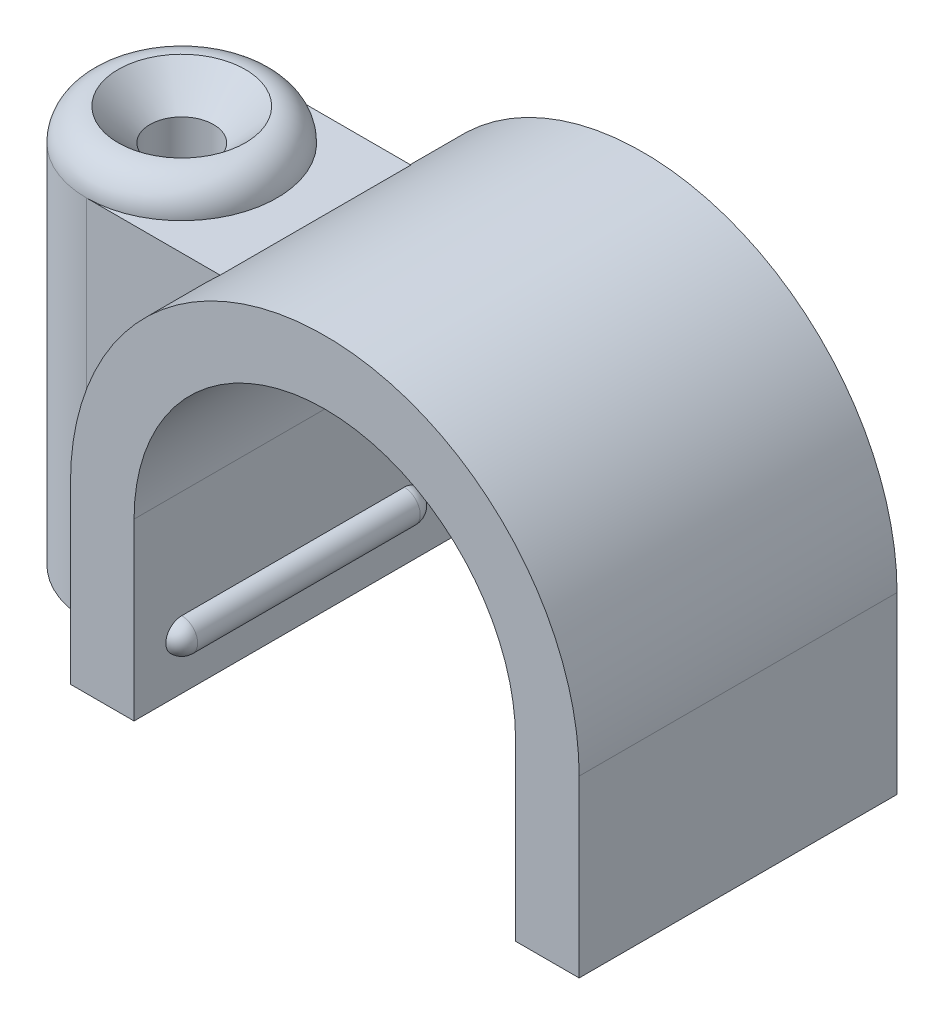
ISO-10303-21;
HEADER;
FILE_DESCRIPTION(('STEP AP214'),'2;1');
FILE_NAME('part.step','',(''),(''),'','','');
FILE_SCHEMA(('AUTOMOTIVE_DESIGN { 1 0 10303 214 1 1 1 1 }'));
ENDSEC;
DATA;
#1=APPLICATION_CONTEXT('core data for automotive mechanical design processes');
#2=APPLICATION_PROTOCOL_DEFINITION('international standard','automotive_design',2000,#1);
#3=PRODUCT_CONTEXT('',#1,'mechanical');
#4=PRODUCT('Part','Part','',(#3));
#5=PRODUCT_RELATED_PRODUCT_CATEGORY('part','',(#4));
#6=PRODUCT_DEFINITION_FORMATION('','',#4);
#7=PRODUCT_DEFINITION_CONTEXT('part definition',#1,'design');
#8=PRODUCT_DEFINITION('design','',#6,#7);
#9=PRODUCT_DEFINITION_SHAPE('','',#8);
#10=(LENGTH_UNIT() NAMED_UNIT(*) SI_UNIT(.MILLI.,.METRE.));
#11=(NAMED_UNIT(*) PLANE_ANGLE_UNIT() SI_UNIT($,.RADIAN.));
#12=(NAMED_UNIT(*) SI_UNIT($,.STERADIAN.) SOLID_ANGLE_UNIT());
#13=UNCERTAINTY_MEASURE_WITH_UNIT(LENGTH_MEASURE(1.E-05),#10,'distance_accuracy_value','');
#14=(GEOMETRIC_REPRESENTATION_CONTEXT(3) GLOBAL_UNCERTAINTY_ASSIGNED_CONTEXT((#13)) GLOBAL_UNIT_ASSIGNED_CONTEXT((#10,
#11,#12)) REPRESENTATION_CONTEXT('',''));
#15=CARTESIAN_POINT('',(0.,0.,0.));
#16=DIRECTION('',(0.,0.,1.));
#17=DIRECTION('',(1.,0.,0.));
#18=AXIS2_PLACEMENT_3D('',#15,#16,#17);
#19=CARTESIAN_POINT('',(0.,0.,-10.));
#20=DIRECTION('',(0.,-1.,0.));
#21=DIRECTION('',(0.,0.,-1.));
#22=AXIS2_PLACEMENT_3D('',#19,#20,#21);
#23=PLANE('',#22);
#24=DIRECTION('',(0.,0.,1.));
#25=VECTOR('',#24,1.);
#26=CARTESIAN_POINT('',(0.,0.,-10.));
#27=LINE('',#26,#25);
#28=CARTESIAN_POINT('',(0.,0.,-2.));
#29=VERTEX_POINT('',#28);
#30=CARTESIAN_POINT('',(0.,0.,0.));
#31=VERTEX_POINT('',#30);
#32=EDGE_CURVE('E262',#29,#31,#27,.T.);
#33=ORIENTED_EDGE('',*,*,#32,.F.);
#34=DIRECTION('',(-1.,0.,0.));
#35=VECTOR('',#34,1.);
#36=CARTESIAN_POINT('',(16.001,0.,-2.));
#37=LINE('',#36,#35);
#38=CARTESIAN_POINT('',(-1.5,0.,-2.));
#39=VERTEX_POINT('',#38);
#40=EDGE_CURVE('E172',#29,#39,#37,.T.);
#41=ORIENTED_EDGE('',*,*,#40,.T.);
#42=CARTESIAN_POINT('',(-1.5,0.,-5.));
#43=DIRECTION('',(0.,-1.,0.));
#44=DIRECTION('',(0.,0.,-1.));
#45=AXIS2_PLACEMENT_3D('',#42,#43,#44);
#46=CIRCLE('',#45,3.);
#47=CARTESIAN_POINT('',(-1.5,0.,-8.));
#48=VERTEX_POINT('',#47);
#49=EDGE_CURVE('E201',#39,#48,#46,.T.);
#50=ORIENTED_EDGE('',*,*,#49,.T.);
#51=DIRECTION('',(-1.,0.,0.));
#52=VECTOR('',#51,1.);
#53=CARTESIAN_POINT('',(16.001,0.,-8.));
#54=LINE('',#53,#52);
#55=CARTESIAN_POINT('',(0.,0.,-8.));
#56=VERTEX_POINT('',#55);
#57=EDGE_CURVE('E190',#56,#48,#54,.T.);
#58=ORIENTED_EDGE('',*,*,#57,.F.);
#59=CARTESIAN_POINT('',(0.,0.,-10.));
#60=VERTEX_POINT('',#59);
#61=EDGE_CURVE('E258',#60,#56,#27,.T.);
#62=ORIENTED_EDGE('',*,*,#61,.F.);
#63=DIRECTION('',(1.,0.,0.));
#64=VECTOR('',#63,1.);
#65=CARTESIAN_POINT('',(0.,0.,-10.));
#66=LINE('',#65,#64);
#67=CARTESIAN_POINT('',(2.,0.,-10.));
#68=VERTEX_POINT('',#67);
#69=EDGE_CURVE('E234',#60,#68,#66,.T.);
#70=ORIENTED_EDGE('',*,*,#69,.T.);
#71=DIRECTION('',(0.,0.,1.));
#72=VECTOR('',#71,1.);
#73=CARTESIAN_POINT('',(2.,0.,-10.));
#74=LINE('',#73,#72);
#75=CARTESIAN_POINT('',(2.,0.,0.));
#76=VERTEX_POINT('',#75);
#77=EDGE_CURVE('E257',#68,#76,#74,.T.);
#78=ORIENTED_EDGE('',*,*,#77,.T.);
#79=DIRECTION('',(1.,0.,0.));
#80=VECTOR('',#79,1.);
#81=CARTESIAN_POINT('',(0.,0.,0.));
#82=LINE('',#81,#80);
#83=EDGE_CURVE('E210',#31,#76,#82,.T.);
#84=ORIENTED_EDGE('',*,*,#83,.F.);
#85=EDGE_LOOP('',(#33,#41,#50,#58,#62,#70,#78,#84));
#86=FACE_BOUND('',#85,.T.);
#87=CARTESIAN_POINT('',(-1.5,1.1369377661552E-11,-5.));
#88=DIRECTION('',(0.,1.,0.));
#89=DIRECTION('',(0.,0.,1.));
#90=AXIS2_PLACEMENT_3D('',#87,#88,#89);
#91=CIRCLE('',#90,0.999999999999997);
#92=CARTESIAN_POINT('',(-1.5,1.1369377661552E-11,-4.));
#93=VERTEX_POINT('',#92);
#94=EDGE_CURVE('E336',#93,#93,#91,.T.);
#95=ORIENTED_EDGE('',*,*,#94,.T.);
#96=EDGE_LOOP('',(#95));
#97=FACE_BOUND('',#96,.T.);
#98=ADVANCED_FACE('F33',(#86,#97),#23,.T.);
#99=CARTESIAN_POINT('',(0.,0.,-10.));
#100=DIRECTION('',(-1.,0.,0.));
#101=DIRECTION('',(0.,0.,1.));
#102=AXIS2_PLACEMENT_3D('',#99,#100,#101);
#103=PLANE('',#102);
#104=ORIENTED_EDGE('',*,*,#61,.T.);
#105=DIRECTION('',(0.,-1.,0.));
#106=VECTOR('',#105,1.);
#107=CARTESIAN_POINT('',(0.,0.,-8.));
#108=LINE('',#107,#106);
#109=CARTESIAN_POINT('',(0.,5.5,-8.));
#110=VERTEX_POINT('',#109);
#111=EDGE_CURVE('E187',#110,#56,#108,.T.);
#112=ORIENTED_EDGE('',*,*,#111,.F.);
#113=DIRECTION('',(0.,0.,1.));
#114=VECTOR('',#113,1.);
#115=CARTESIAN_POINT('',(0.,5.5,-10.));
#116=LINE('',#115,#114);
#117=CARTESIAN_POINT('',(0.,5.5,-10.));
#118=VERTEX_POINT('',#117);
#119=EDGE_CURVE('E186',#118,#110,#116,.T.);
#120=ORIENTED_EDGE('',*,*,#119,.F.);
#121=DIRECTION('',(0.,-1.,0.));
#122=VECTOR('',#121,1.);
#123=CARTESIAN_POINT('',(0.,0.,-10.));
#124=LINE('',#123,#122);
#125=EDGE_CURVE('E254',#118,#60,#124,.T.);
#126=ORIENTED_EDGE('',*,*,#125,.T.);
#127=EDGE_LOOP('',(#104,#112,#120,#126));
#128=FACE_BOUND('',#127,.T.);
#129=ADVANCED_FACE('F321',(#128),#103,.T.);
#130=CARTESIAN_POINT('',(0.,5.5,-2.));
#131=VERTEX_POINT('',#130);
#132=CARTESIAN_POINT('',(0.,5.5,0.));
#133=VERTEX_POINT('',#132);
#134=EDGE_CURVE('E264',#131,#133,#116,.T.);
#135=ORIENTED_EDGE('',*,*,#134,.F.);
#136=DIRECTION('',(0.,1.,0.));
#137=VECTOR('',#136,1.);
#138=CARTESIAN_POINT('',(0.,0.,-2.));
#139=LINE('',#138,#137);
#140=EDGE_CURVE('E198',#29,#131,#139,.T.);
#141=ORIENTED_EDGE('',*,*,#140,.F.);
#142=ORIENTED_EDGE('',*,*,#32,.T.);
#143=DIRECTION('',(0.,-1.,0.));
#144=VECTOR('',#143,1.);
#145=CARTESIAN_POINT('',(0.,0.,0.));
#146=LINE('',#145,#144);
#147=EDGE_CURVE('E231',#133,#31,#146,.T.);
#148=ORIENTED_EDGE('',*,*,#147,.F.);
#149=EDGE_LOOP('',(#135,#141,#142,#148));
#150=FACE_BOUND('',#149,.T.);
#151=ADVANCED_FACE('F328',(#150),#103,.T.);
#152=CARTESIAN_POINT('',(8.,5.5,-10.));
#153=DIRECTION('',(0.,0.,1.));
#154=DIRECTION('',(1.,0.,0.));
#155=AXIS2_PLACEMENT_3D('',#152,#153,#154);
#156=CYLINDRICAL_SURFACE('',#155,8.);
#157=ORIENTED_EDGE('',*,*,#119,.T.);
#158=CARTESIAN_POINT('',(8.,5.5,-8.));
#159=DIRECTION('',(0.,0.,1.));
#160=DIRECTION('',(1.,0.,0.));
#161=AXIS2_PLACEMENT_3D('',#158,#159,#160);
#162=CIRCLE('',#161,8.);
#163=CARTESIAN_POINT('',(2.70849737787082,11.5,-8.));
#164=VERTEX_POINT('',#163);
#165=EDGE_CURVE('E177',#164,#110,#162,.T.);
#166=ORIENTED_EDGE('',*,*,#165,.F.);
#167=DIRECTION('',(0.,0.,1.));
#168=VECTOR('',#167,1.);
#169=CARTESIAN_POINT('',(2.70849737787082,11.5,-10.));
#170=LINE('',#169,#168);
#171=CARTESIAN_POINT('',(2.70849737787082,11.5,-2.));
#172=VERTEX_POINT('',#171);
#173=EDGE_CURVE('E161',#172,#164,#170,.F.);
#174=ORIENTED_EDGE('',*,*,#173,.F.);
#175=CARTESIAN_POINT('',(8.,5.5,-2.));
#176=DIRECTION('',(0.,0.,-1.));
#177=DIRECTION('',(0.,1.,0.));
#178=AXIS2_PLACEMENT_3D('',#175,#176,#177);
#179=CIRCLE('',#178,8.);
#180=EDGE_CURVE('E200',#131,#172,#179,.T.);
#181=ORIENTED_EDGE('',*,*,#180,.F.);
#182=ORIENTED_EDGE('',*,*,#134,.T.);
#183=CARTESIAN_POINT('',(8.,5.5,0.));
#184=DIRECTION('',(0.,0.,1.));
#185=DIRECTION('',(-1.,0.,0.));
#186=AXIS2_PLACEMENT_3D('',#183,#184,#185);
#187=CIRCLE('',#186,8.);
#188=CARTESIAN_POINT('',(16.,5.5,0.));
#189=VERTEX_POINT('',#188);
#190=EDGE_CURVE('E228',#189,#133,#187,.T.);
#191=ORIENTED_EDGE('',*,*,#190,.F.);
#192=DIRECTION('',(0.,0.,1.));
#193=VECTOR('',#192,1.);
#194=CARTESIAN_POINT('',(16.,5.5,-10.));
#195=LINE('',#194,#193);
#196=CARTESIAN_POINT('',(16.,5.5,-10.));
#197=VERTEX_POINT('',#196);
#198=EDGE_CURVE('E265',#197,#189,#195,.T.);
#199=ORIENTED_EDGE('',*,*,#198,.F.);
#200=CARTESIAN_POINT('',(8.,5.5,-10.));
#201=DIRECTION('',(0.,0.,1.));
#202=DIRECTION('',(-1.,0.,0.));
#203=AXIS2_PLACEMENT_3D('',#200,#201,#202);
#204=CIRCLE('',#203,8.);
#205=EDGE_CURVE('E252',#197,#118,#204,.T.);
#206=ORIENTED_EDGE('',*,*,#205,.T.);
#207=EDGE_LOOP('',(#157,#166,#174,#181,#182,#191,#199,#206));
#208=FACE_BOUND('',#207,.T.);
#209=ADVANCED_FACE('F184',(#208),#156,.T.);
#210=CARTESIAN_POINT('',(16.,0.,-10.));
#211=DIRECTION('',(1.,0.,0.));
#212=DIRECTION('',(0.,0.,-1.));
#213=AXIS2_PLACEMENT_3D('',#210,#211,#212);
#214=PLANE('',#213);
#215=DIRECTION('',(0.,1.,0.));
#216=VECTOR('',#215,1.);
#217=CARTESIAN_POINT('',(16.,0.,0.));
#218=LINE('',#217,#216);
#219=CARTESIAN_POINT('',(16.,0.,0.));
#220=VERTEX_POINT('',#219);
#221=EDGE_CURVE('E225',#220,#189,#218,.T.);
#222=ORIENTED_EDGE('',*,*,#221,.F.);
#223=DIRECTION('',(0.,0.,1.));
#224=VECTOR('',#223,1.);
#225=CARTESIAN_POINT('',(16.,0.,-10.));
#226=LINE('',#225,#224);
#227=CARTESIAN_POINT('',(16.,0.,-10.));
#228=VERTEX_POINT('',#227);
#229=EDGE_CURVE('E267',#228,#220,#226,.T.);
#230=ORIENTED_EDGE('',*,*,#229,.F.);
#231=DIRECTION('',(0.,1.,0.));
#232=VECTOR('',#231,1.);
#233=CARTESIAN_POINT('',(16.,0.,-10.));
#234=LINE('',#233,#232);
#235=EDGE_CURVE('E249',#228,#197,#234,.T.);
#236=ORIENTED_EDGE('',*,*,#235,.T.);
#237=ORIENTED_EDGE('',*,*,#198,.T.);
#238=EDGE_LOOP('',(#222,#230,#236,#237));
#239=FACE_BOUND('',#238,.T.);
#240=ADVANCED_FACE('F376',(#239),#214,.T.);
#241=CARTESIAN_POINT('',(14.,0.,-10.));
#242=DIRECTION('',(0.,-1.,0.));
#243=DIRECTION('',(0.,0.,-1.));
#244=AXIS2_PLACEMENT_3D('',#241,#242,#243);
#245=PLANE('',#244);
#246=DIRECTION('',(1.,0.,0.));
#247=VECTOR('',#246,1.);
#248=CARTESIAN_POINT('',(14.,0.,0.));
#249=LINE('',#248,#247);
#250=CARTESIAN_POINT('',(14.,0.,0.));
#251=VERTEX_POINT('',#250);
#252=EDGE_CURVE('E222',#251,#220,#249,.T.);
#253=ORIENTED_EDGE('',*,*,#252,.F.);
#254=DIRECTION('',(0.,0.,1.));
#255=VECTOR('',#254,1.);
#256=CARTESIAN_POINT('',(14.,0.,-10.));
#257=LINE('',#256,#255);
#258=CARTESIAN_POINT('',(14.,0.,-10.));
#259=VERTEX_POINT('',#258);
#260=EDGE_CURVE('E269',#259,#251,#257,.T.);
#261=ORIENTED_EDGE('',*,*,#260,.F.);
#262=DIRECTION('',(1.,0.,0.));
#263=VECTOR('',#262,1.);
#264=CARTESIAN_POINT('',(14.,0.,-10.));
#265=LINE('',#264,#263);
#266=EDGE_CURVE('E246',#259,#228,#265,.T.);
#267=ORIENTED_EDGE('',*,*,#266,.T.);
#268=ORIENTED_EDGE('',*,*,#229,.T.);
#269=EDGE_LOOP('',(#253,#261,#267,#268));
#270=FACE_BOUND('',#269,.T.);
#271=ADVANCED_FACE('F380',(#270),#245,.T.);
#272=CARTESIAN_POINT('',(14.,0.,-10.));
#273=DIRECTION('',(-1.,0.,0.));
#274=DIRECTION('',(0.,0.,1.));
#275=AXIS2_PLACEMENT_3D('',#272,#273,#274);
#276=PLANE('',#275);
#277=CARTESIAN_POINT('',(14.,1.61906828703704,-1.5));
#278=DIRECTION('',(-1.,0.,0.));
#279=DIRECTION('',(0.,0.,1.));
#280=AXIS2_PLACEMENT_3D('',#277,#278,#279);
#281=CIRCLE('',#280,0.5);
#282=CARTESIAN_POINT('',(14.,2.11906828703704,-1.5));
#283=VERTEX_POINT('',#282);
#284=CARTESIAN_POINT('',(14.,1.61906828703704,-1.));
#285=VERTEX_POINT('',#284);
#286=EDGE_CURVE('E52',#283,#285,#281,.F.);
#287=ORIENTED_EDGE('',*,*,#286,.T.);
#288=CARTESIAN_POINT('',(14.,1.61906828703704,-1.5));
#289=DIRECTION('',(-1.,0.,0.));
#290=DIRECTION('',(0.,0.,1.));
#291=AXIS2_PLACEMENT_3D('',#288,#289,#290);
#292=CIRCLE('',#291,0.5);
#293=CARTESIAN_POINT('',(14.,1.11906828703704,-1.5));
#294=VERTEX_POINT('',#293);
#295=EDGE_CURVE('E298',#285,#294,#292,.F.);
#296=ORIENTED_EDGE('',*,*,#295,.T.);
#297=DIRECTION('',(0.,0.,-1.));
#298=VECTOR('',#297,1.);
#299=CARTESIAN_POINT('',(14.,1.11906828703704,-1.));
#300=LINE('',#299,#298);
#301=CARTESIAN_POINT('',(14.,1.11906828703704,-8.5));
#302=VERTEX_POINT('',#301);
#303=EDGE_CURVE('E309',#294,#302,#300,.T.);
#304=ORIENTED_EDGE('',*,*,#303,.T.);
#305=CARTESIAN_POINT('',(14.,1.61906828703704,-8.5));
#306=DIRECTION('',(-1.,0.,0.));
#307=DIRECTION('',(0.,0.,1.));
#308=AXIS2_PLACEMENT_3D('',#305,#306,#307);
#309=CIRCLE('',#308,0.5);
#310=CARTESIAN_POINT('',(14.,1.61906828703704,-9.));
#311=VERTEX_POINT('',#310);
#312=EDGE_CURVE('E13',#302,#311,#309,.F.);
#313=ORIENTED_EDGE('',*,*,#312,.T.);
#314=CARTESIAN_POINT('',(14.,1.61906828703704,-8.5));
#315=DIRECTION('',(-1.,0.,0.));
#316=DIRECTION('',(0.,0.,1.));
#317=AXIS2_PLACEMENT_3D('',#314,#315,#316);
#318=CIRCLE('',#317,0.5);
#319=CARTESIAN_POINT('',(14.,2.11906828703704,-8.5));
#320=VERTEX_POINT('',#319);
#321=EDGE_CURVE('E40',#311,#320,#318,.F.);
#322=ORIENTED_EDGE('',*,*,#321,.T.);
#323=DIRECTION('',(0.,0.,-1.));
#324=VECTOR('',#323,1.);
#325=CARTESIAN_POINT('',(14.,2.11906828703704,-1.));
#326=LINE('',#325,#324);
#327=EDGE_CURVE('E302',#283,#320,#326,.T.);
#328=ORIENTED_EDGE('',*,*,#327,.F.);
#329=EDGE_LOOP('',(#287,#296,#304,#313,#322,#328));
#330=FACE_BOUND('',#329,.T.);
#331=DIRECTION('',(0.,-1.,0.));
#332=VECTOR('',#331,1.);
#333=CARTESIAN_POINT('',(14.,0.,0.));
#334=LINE('',#333,#332);
#335=CARTESIAN_POINT('',(14.,5.5,0.));
#336=VERTEX_POINT('',#335);
#337=EDGE_CURVE('E219',#336,#251,#334,.T.);
#338=ORIENTED_EDGE('',*,*,#337,.F.);
#339=DIRECTION('',(0.,0.,1.));
#340=VECTOR('',#339,1.);
#341=CARTESIAN_POINT('',(14.,5.5,-10.));
#342=LINE('',#341,#340);
#343=CARTESIAN_POINT('',(14.,5.5,-10.));
#344=VERTEX_POINT('',#343);
#345=EDGE_CURVE('E271',#344,#336,#342,.T.);
#346=ORIENTED_EDGE('',*,*,#345,.F.);
#347=DIRECTION('',(0.,-1.,0.));
#348=VECTOR('',#347,1.);
#349=CARTESIAN_POINT('',(14.,0.,-10.));
#350=LINE('',#349,#348);
#351=EDGE_CURVE('E243',#344,#259,#350,.T.);
#352=ORIENTED_EDGE('',*,*,#351,.T.);
#353=ORIENTED_EDGE('',*,*,#260,.T.);
#354=EDGE_LOOP('',(#338,#346,#352,#353));
#355=FACE_BOUND('',#354,.T.);
#356=ADVANCED_FACE('F300',(#330,#355),#276,.T.);
#357=CARTESIAN_POINT('',(8.,5.5,-10.));
#358=DIRECTION('',(0.,0.,1.));
#359=DIRECTION('',(1.,0.,0.));
#360=AXIS2_PLACEMENT_3D('',#357,#358,#359);
#361=CYLINDRICAL_SURFACE('',#360,6.);
#362=CARTESIAN_POINT('',(8.,5.5,0.));
#363=DIRECTION('',(0.,0.,-1.));
#364=DIRECTION('',(-1.,0.,0.));
#365=AXIS2_PLACEMENT_3D('',#362,#363,#364);
#366=CIRCLE('',#365,6.);
#367=CARTESIAN_POINT('',(2.,5.5,0.));
#368=VERTEX_POINT('',#367);
#369=EDGE_CURVE('E216',#368,#336,#366,.T.);
#370=ORIENTED_EDGE('',*,*,#369,.F.);
#371=DIRECTION('',(0.,0.,1.));
#372=VECTOR('',#371,1.);
#373=CARTESIAN_POINT('',(2.,5.5,-10.));
#374=LINE('',#373,#372);
#375=CARTESIAN_POINT('',(2.,5.5,-10.));
#376=VERTEX_POINT('',#375);
#377=EDGE_CURVE('E273',#376,#368,#374,.T.);
#378=ORIENTED_EDGE('',*,*,#377,.F.);
#379=CARTESIAN_POINT('',(8.,5.5,-10.));
#380=DIRECTION('',(0.,0.,-1.));
#381=DIRECTION('',(-1.,0.,0.));
#382=AXIS2_PLACEMENT_3D('',#379,#380,#381);
#383=CIRCLE('',#382,6.);
#384=EDGE_CURVE('E240',#376,#344,#383,.T.);
#385=ORIENTED_EDGE('',*,*,#384,.T.);
#386=ORIENTED_EDGE('',*,*,#345,.T.);
#387=EDGE_LOOP('',(#370,#378,#385,#386));
#388=FACE_BOUND('',#387,.T.);
#389=ADVANCED_FACE('F383',(#388),#361,.F.);
#390=CARTESIAN_POINT('',(2.,0.,-10.));
#391=DIRECTION('',(1.,0.,0.));
#392=DIRECTION('',(0.,0.,-1.));
#393=AXIS2_PLACEMENT_3D('',#390,#391,#392);
#394=PLANE('',#393);
#395=DIRECTION('',(0.,0.,-1.));
#396=VECTOR('',#395,1.);
#397=CARTESIAN_POINT('',(2.,1.11906828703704,-1.));
#398=LINE('',#397,#396);
#399=CARTESIAN_POINT('',(2.,1.11906828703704,-1.5));
#400=VERTEX_POINT('',#399);
#401=CARTESIAN_POINT('',(2.,1.11906828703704,-8.5));
#402=VERTEX_POINT('',#401);
#403=EDGE_CURVE('E343',#400,#402,#398,.T.);
#404=ORIENTED_EDGE('',*,*,#403,.F.);
#405=CARTESIAN_POINT('',(2.,1.61906828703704,-1.5));
#406=DIRECTION('',(1.,0.,0.));
#407=DIRECTION('',(0.,0.,-1.));
#408=AXIS2_PLACEMENT_3D('',#405,#406,#407);
#409=CIRCLE('',#408,0.5);
#410=CARTESIAN_POINT('',(2.,1.61906828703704,-1.));
#411=VERTEX_POINT('',#410);
#412=EDGE_CURVE('E285',#400,#411,#409,.F.);
#413=ORIENTED_EDGE('',*,*,#412,.T.);
#414=CARTESIAN_POINT('',(2.,1.61906828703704,-1.5));
#415=DIRECTION('',(1.,0.,0.));
#416=DIRECTION('',(0.,0.,-1.));
#417=AXIS2_PLACEMENT_3D('',#414,#415,#416);
#418=CIRCLE('',#417,0.5);
#419=CARTESIAN_POINT('',(2.,2.11906828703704,-1.5));
#420=VERTEX_POINT('',#419);
#421=EDGE_CURVE('E283',#411,#420,#418,.F.);
#422=ORIENTED_EDGE('',*,*,#421,.T.);
#423=DIRECTION('',(0.,0.,-1.));
#424=VECTOR('',#423,1.);
#425=CARTESIAN_POINT('',(2.,2.11906828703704,-1.));
#426=LINE('',#425,#424);
#427=CARTESIAN_POINT('',(2.,2.11906828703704,-8.5));
#428=VERTEX_POINT('',#427);
#429=EDGE_CURVE('E338',#420,#428,#426,.T.);
#430=ORIENTED_EDGE('',*,*,#429,.T.);
#431=CARTESIAN_POINT('',(2.,1.61906828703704,-8.5));
#432=DIRECTION('',(1.,0.,0.));
#433=DIRECTION('',(0.,0.,-1.));
#434=AXIS2_PLACEMENT_3D('',#431,#432,#433);
#435=CIRCLE('',#434,0.5);
#436=CARTESIAN_POINT('',(2.,1.61906828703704,-9.));
#437=VERTEX_POINT('',#436);
#438=EDGE_CURVE('E287',#428,#437,#435,.F.);
#439=ORIENTED_EDGE('',*,*,#438,.T.);
#440=CARTESIAN_POINT('',(2.,1.61906828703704,-8.5));
#441=DIRECTION('',(1.,0.,0.));
#442=DIRECTION('',(0.,0.,-1.));
#443=AXIS2_PLACEMENT_3D('',#440,#441,#442);
#444=CIRCLE('',#443,0.5);
#445=EDGE_CURVE('E289',#437,#402,#444,.F.);
#446=ORIENTED_EDGE('',*,*,#445,.T.);
#447=EDGE_LOOP('',(#404,#413,#422,#430,#439,#446));
#448=FACE_BOUND('',#447,.T.);
#449=DIRECTION('',(0.,1.,0.));
#450=VECTOR('',#449,1.);
#451=CARTESIAN_POINT('',(2.,0.,0.));
#452=LINE('',#451,#450);
#453=EDGE_CURVE('E213',#76,#368,#452,.T.);
#454=ORIENTED_EDGE('',*,*,#453,.F.);
#455=ORIENTED_EDGE('',*,*,#77,.F.);
#456=DIRECTION('',(0.,1.,0.));
#457=VECTOR('',#456,1.);
#458=CARTESIAN_POINT('',(2.,0.,-10.));
#459=LINE('',#458,#457);
#460=EDGE_CURVE('E237',#68,#376,#459,.T.);
#461=ORIENTED_EDGE('',*,*,#460,.T.);
#462=ORIENTED_EDGE('',*,*,#377,.T.);
#463=EDGE_LOOP('',(#454,#455,#461,#462));
#464=FACE_BOUND('',#463,.T.);
#465=ADVANCED_FACE('F365',(#448,#464),#394,.T.);
#466=CARTESIAN_POINT('',(8.,5.5,-10.));
#467=DIRECTION('',(0.,0.,-1.));
#468=DIRECTION('',(-1.,0.,0.));
#469=AXIS2_PLACEMENT_3D('',#466,#467,#468);
#470=PLANE('',#469);
#471=ORIENTED_EDGE('',*,*,#69,.F.);
#472=ORIENTED_EDGE('',*,*,#125,.F.);
#473=ORIENTED_EDGE('',*,*,#205,.F.);
#474=ORIENTED_EDGE('',*,*,#235,.F.);
#475=ORIENTED_EDGE('',*,*,#266,.F.);
#476=ORIENTED_EDGE('',*,*,#351,.F.);
#477=ORIENTED_EDGE('',*,*,#384,.F.);
#478=ORIENTED_EDGE('',*,*,#460,.F.);
#479=EDGE_LOOP('',(#471,#472,#473,#474,#475,#476,#477,#478));
#480=FACE_BOUND('',#479,.T.);
#481=ADVANCED_FACE('F359',(#480),#470,.T.);
#482=CARTESIAN_POINT('',(8.,5.5,0.));
#483=DIRECTION('',(0.,0.,-1.));
#484=DIRECTION('',(-1.,0.,0.));
#485=AXIS2_PLACEMENT_3D('',#482,#483,#484);
#486=PLANE('',#485);
#487=ORIENTED_EDGE('',*,*,#83,.T.);
#488=ORIENTED_EDGE('',*,*,#453,.T.);
#489=ORIENTED_EDGE('',*,*,#369,.T.);
#490=ORIENTED_EDGE('',*,*,#337,.T.);
#491=ORIENTED_EDGE('',*,*,#252,.T.);
#492=ORIENTED_EDGE('',*,*,#221,.T.);
#493=ORIENTED_EDGE('',*,*,#190,.T.);
#494=ORIENTED_EDGE('',*,*,#147,.T.);
#495=EDGE_LOOP('',(#487,#488,#489,#490,#491,#492,#493,#494));
#496=FACE_BOUND('',#495,.T.);
#497=ADVANCED_FACE('F368',(#496),#486,.F.);
#498=CARTESIAN_POINT('',(-1.5,12.5,-5.));
#499=DIRECTION('',(0.,-1.,0.));
#500=DIRECTION('',(0.,0.,-1.));
#501=AXIS2_PLACEMENT_3D('',#498,#499,#500);
#502=CYLINDRICAL_SURFACE('',#501,3.);
#503=DIRECTION('',(0.,-1.,0.));
#504=VECTOR('',#503,1.);
#505=CARTESIAN_POINT('',(-1.5,0.,-2.));
#506=LINE('',#505,#504);
#507=CARTESIAN_POINT('',(-1.5,11.5,-2.));
#508=VERTEX_POINT('',#507);
#509=EDGE_CURVE('E204',#508,#39,#506,.T.);
#510=ORIENTED_EDGE('',*,*,#509,.F.);
#511=CARTESIAN_POINT('',(-1.5,11.5,-5.));
#512=DIRECTION('',(0.,-1.,0.));
#513=DIRECTION('',(0.,0.,-1.));
#514=AXIS2_PLACEMENT_3D('',#511,#512,#513);
#515=CIRCLE('',#514,3.);
#516=CARTESIAN_POINT('',(-1.5,11.5,-8.));
#517=VERTEX_POINT('',#516);
#518=EDGE_CURVE('E261',#508,#517,#515,.T.);
#519=ORIENTED_EDGE('',*,*,#518,.T.);
#520=DIRECTION('',(0.,1.,0.));
#521=VECTOR('',#520,1.);
#522=CARTESIAN_POINT('',(-1.5,0.,-8.));
#523=LINE('',#522,#521);
#524=EDGE_CURVE('E180',#48,#517,#523,.T.);
#525=ORIENTED_EDGE('',*,*,#524,.F.);
#526=ORIENTED_EDGE('',*,*,#49,.F.);
#527=EDGE_LOOP('',(#510,#519,#525,#526));
#528=FACE_BOUND('',#527,.T.);
#529=ADVANCED_FACE('F353',(#528),#502,.T.);
#530=CARTESIAN_POINT('',(16.001,0.,-8.));
#531=DIRECTION('',(0.,0.,1.));
#532=DIRECTION('',(1.,0.,0.));
#533=AXIS2_PLACEMENT_3D('',#530,#531,#532);
#534=PLANE('',#533);
#535=ORIENTED_EDGE('',*,*,#165,.T.);
#536=ORIENTED_EDGE('',*,*,#111,.T.);
#537=ORIENTED_EDGE('',*,*,#57,.T.);
#538=ORIENTED_EDGE('',*,*,#524,.T.);
#539=DIRECTION('',(-1.,0.,0.));
#540=VECTOR('',#539,1.);
#541=CARTESIAN_POINT('',(16.001,11.5,-8.));
#542=LINE('',#541,#540);
#543=EDGE_CURVE('E165',#164,#517,#542,.T.);
#544=ORIENTED_EDGE('',*,*,#543,.F.);
#545=EDGE_LOOP('',(#535,#536,#537,#538,#544));
#546=FACE_BOUND('',#545,.T.);
#547=ADVANCED_FACE('F176',(#546),#534,.F.);
#548=CARTESIAN_POINT('',(16.001,0.,-2.));
#549=DIRECTION('',(0.,0.,-1.));
#550=DIRECTION('',(0.,1.,0.));
#551=AXIS2_PLACEMENT_3D('',#548,#549,#550);
#552=PLANE('',#551);
#553=ORIENTED_EDGE('',*,*,#40,.F.);
#554=ORIENTED_EDGE('',*,*,#140,.T.);
#555=ORIENTED_EDGE('',*,*,#180,.T.);
#556=DIRECTION('',(-1.,0.,0.));
#557=VECTOR('',#556,1.);
#558=CARTESIAN_POINT('',(16.001,11.5,-2.));
#559=LINE('',#558,#557);
#560=EDGE_CURVE('E168',#172,#508,#559,.T.);
#561=ORIENTED_EDGE('',*,*,#560,.T.);
#562=ORIENTED_EDGE('',*,*,#509,.T.);
#563=EDGE_LOOP('',(#553,#554,#555,#561,#562));
#564=FACE_BOUND('',#563,.T.);
#565=ADVANCED_FACE('F350',(#564),#552,.F.);
#566=CARTESIAN_POINT('',(16.001,11.5,-8.));
#567=DIRECTION('',(0.,-1.,0.));
#568=DIRECTION('',(0.,0.,-1.));
#569=AXIS2_PLACEMENT_3D('',#566,#567,#568);
#570=PLANE('',#569);
#571=ORIENTED_EDGE('',*,*,#560,.F.);
#572=ORIENTED_EDGE('',*,*,#173,.T.);
#573=ORIENTED_EDGE('',*,*,#543,.T.);
#574=CARTESIAN_POINT('',(-1.5,11.5,-5.));
#575=DIRECTION('',(0.,-1.,0.));
#576=DIRECTION('',(0.,0.,-1.));
#577=AXIS2_PLACEMENT_3D('',#574,#575,#576);
#578=CIRCLE('',#577,3.);
#579=EDGE_CURVE('E181',#517,#508,#578,.T.);
#580=ORIENTED_EDGE('',*,*,#579,.T.);
#581=EDGE_LOOP('',(#571,#572,#573,#580));
#582=FACE_BOUND('',#581,.T.);
#583=ADVANCED_FACE('F163',(#582),#570,.F.);
#584=CARTESIAN_POINT('',(-1.5,11.5,-5.));
#585=DIRECTION('',(0.,-1.,0.));
#586=DIRECTION('',(0.,0.,-1.));
#587=AXIS2_PLACEMENT_3D('',#584,#585,#586);
#588=TOROIDAL_SURFACE('',#587,2.,1.);
#589=CARTESIAN_POINT('',(-1.5,12.5,-5.));
#590=DIRECTION('',(0.,1.,0.));
#591=DIRECTION('',(0.,0.,1.));
#592=AXIS2_PLACEMENT_3D('',#589,#590,#591);
#593=CIRCLE('',#592,2.);
#594=CARTESIAN_POINT('',(-1.5,12.5,-3.));
#595=VERTEX_POINT('',#594);
#596=EDGE_CURVE('E188',#595,#595,#593,.T.);
#597=ORIENTED_EDGE('',*,*,#596,.F.);
#598=EDGE_LOOP('',(#597));
#599=FACE_BOUND('',#598,.T.);
#600=ORIENTED_EDGE('',*,*,#518,.F.);
#601=ORIENTED_EDGE('',*,*,#579,.F.);
#602=EDGE_LOOP('',(#600,#601));
#603=FACE_BOUND('',#602,.T.);
#604=ADVANCED_FACE('F411',(#599,#603),#588,.T.);
#605=CARTESIAN_POINT('',(-1.5,12.5,-5.));
#606=DIRECTION('',(0.,1.,0.));
#607=DIRECTION('',(0.,0.,1.));
#608=AXIS2_PLACEMENT_3D('',#605,#606,#607);
#609=CONICAL_SURFACE('',#608,2.,0.785398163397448);
#610=CARTESIAN_POINT('',(-1.5,11.5,-5.));
#611=DIRECTION('',(0.,1.,0.));
#612=DIRECTION('',(0.,0.,1.));
#613=AXIS2_PLACEMENT_3D('',#610,#611,#612);
#614=CIRCLE('',#613,0.999999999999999);
#615=CARTESIAN_POINT('',(-1.5,11.5,-4.));
#616=VERTEX_POINT('',#615);
#617=EDGE_CURVE('E193',#616,#616,#614,.T.);
#618=ORIENTED_EDGE('',*,*,#617,.F.);
#619=EDGE_LOOP('',(#618));
#620=FACE_BOUND('',#619,.T.);
#621=ORIENTED_EDGE('',*,*,#596,.T.);
#622=EDGE_LOOP('',(#621));
#623=FACE_BOUND('',#622,.T.);
#624=ADVANCED_FACE('F414',(#620,#623),#609,.F.);
#625=CARTESIAN_POINT('',(-1.5,12.5,-5.));
#626=DIRECTION('',(0.,1.,0.));
#627=DIRECTION('',(0.,0.,1.));
#628=AXIS2_PLACEMENT_3D('',#625,#626,#627);
#629=CYLINDRICAL_SURFACE('',#628,0.999999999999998);
#630=ORIENTED_EDGE('',*,*,#94,.F.);
#631=EDGE_LOOP('',(#630));
#632=FACE_BOUND('',#631,.T.);
#633=ORIENTED_EDGE('',*,*,#617,.T.);
#634=EDGE_LOOP('',(#633));
#635=FACE_BOUND('',#634,.T.);
#636=ADVANCED_FACE('F417',(#632,#635),#629,.F.);
#637=CARTESIAN_POINT('',(2.,1.61906828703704,-1.));
#638=DIRECTION('',(0.,0.,-1.));
#639=DIRECTION('',(-1.,0.,0.));
#640=AXIS2_PLACEMENT_3D('',#637,#638,#639);
#641=CYLINDRICAL_SURFACE('',#640,0.5);
#642=ORIENTED_EDGE('',*,*,#429,.F.);
#643=CARTESIAN_POINT('',(2.,1.61906828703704,-1.5));
#644=DIRECTION('',(0.,0.,-1.));
#645=DIRECTION('',(-1.,0.,0.));
#646=AXIS2_PLACEMENT_3D('',#643,#644,#645);
#647=CIRCLE('',#646,0.5);
#648=EDGE_CURVE('E280',#420,#400,#647,.T.);
#649=ORIENTED_EDGE('',*,*,#648,.T.);
#650=ORIENTED_EDGE('',*,*,#403,.T.);
#651=CARTESIAN_POINT('',(2.,1.61906828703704,-8.5));
#652=DIRECTION('',(0.,0.,-1.));
#653=DIRECTION('',(-1.,0.,0.));
#654=AXIS2_PLACEMENT_3D('',#651,#652,#653);
#655=CIRCLE('',#654,0.5);
#656=EDGE_CURVE('E277',#402,#428,#655,.F.);
#657=ORIENTED_EDGE('',*,*,#656,.T.);
#658=EDGE_LOOP('',(#642,#649,#650,#657));
#659=FACE_BOUND('',#658,.T.);
#660=ADVANCED_FACE('F421',(#659),#641,.T.);
#661=CARTESIAN_POINT('',(2.,1.61906828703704,-1.5));
#662=DIRECTION('',(0.,0.,1.));
#663=DIRECTION('',(1.,0.,0.));
#664=AXIS2_PLACEMENT_3D('',#661,#662,#663);
#665=SPHERICAL_SURFACE('',#664,0.5);
#666=ORIENTED_EDGE('',*,*,#412,.F.);
#667=ORIENTED_EDGE('',*,*,#648,.F.);
#668=ORIENTED_EDGE('',*,*,#421,.F.);
#669=EDGE_LOOP('',(#666,#667,#668));
#670=FACE_BOUND('',#669,.T.);
#671=ADVANCED_FACE('F424',(#670),#665,.T.);
#672=CARTESIAN_POINT('',(2.,1.61906828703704,-8.5));
#673=DIRECTION('',(0.,0.,1.));
#674=DIRECTION('',(1.,0.,0.));
#675=AXIS2_PLACEMENT_3D('',#672,#673,#674);
#676=SPHERICAL_SURFACE('',#675,0.5);
#677=ORIENTED_EDGE('',*,*,#656,.F.);
#678=ORIENTED_EDGE('',*,*,#445,.F.);
#679=ORIENTED_EDGE('',*,*,#438,.F.);
#680=EDGE_LOOP('',(#677,#678,#679));
#681=FACE_BOUND('',#680,.T.);
#682=ADVANCED_FACE('F428',(#681),#676,.T.);
#683=CARTESIAN_POINT('',(14.,1.61906828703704,-1.));
#684=DIRECTION('',(0.,0.,-1.));
#685=DIRECTION('',(-1.,0.,0.));
#686=AXIS2_PLACEMENT_3D('',#683,#684,#685);
#687=CYLINDRICAL_SURFACE('',#686,0.5);
#688=ORIENTED_EDGE('',*,*,#303,.F.);
#689=CARTESIAN_POINT('',(14.,1.61906828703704,-1.5));
#690=DIRECTION('',(0.,0.,-1.));
#691=DIRECTION('',(-1.,0.,0.));
#692=AXIS2_PLACEMENT_3D('',#689,#690,#691);
#693=CIRCLE('',#692,0.5);
#694=EDGE_CURVE('E294',#294,#283,#693,.T.);
#695=ORIENTED_EDGE('',*,*,#694,.T.);
#696=ORIENTED_EDGE('',*,*,#327,.T.);
#697=CARTESIAN_POINT('',(14.,1.61906828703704,-8.5));
#698=DIRECTION('',(0.,0.,-1.));
#699=DIRECTION('',(-1.,0.,0.));
#700=AXIS2_PLACEMENT_3D('',#697,#698,#699);
#701=CIRCLE('',#700,0.5);
#702=EDGE_CURVE('E291',#320,#302,#701,.F.);
#703=ORIENTED_EDGE('',*,*,#702,.T.);
#704=EDGE_LOOP('',(#688,#695,#696,#703));
#705=FACE_BOUND('',#704,.T.);
#706=ADVANCED_FACE('F307',(#705),#687,.T.);
#707=CARTESIAN_POINT('',(14.,1.61906828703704,-1.5));
#708=DIRECTION('',(0.,0.,1.));
#709=DIRECTION('',(1.,0.,0.));
#710=AXIS2_PLACEMENT_3D('',#707,#708,#709);
#711=SPHERICAL_SURFACE('',#710,0.5);
#712=ORIENTED_EDGE('',*,*,#694,.F.);
#713=ORIENTED_EDGE('',*,*,#295,.F.);
#714=ORIENTED_EDGE('',*,*,#286,.F.);
#715=EDGE_LOOP('',(#712,#713,#714));
#716=FACE_BOUND('',#715,.T.);
#717=ADVANCED_FACE('F313',(#716),#711,.T.);
#718=CARTESIAN_POINT('',(14.,1.61906828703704,-8.5));
#719=DIRECTION('',(0.,0.,1.));
#720=DIRECTION('',(1.,0.,0.));
#721=AXIS2_PLACEMENT_3D('',#718,#719,#720);
#722=SPHERICAL_SURFACE('',#721,0.5);
#723=ORIENTED_EDGE('',*,*,#312,.F.);
#724=ORIENTED_EDGE('',*,*,#702,.F.);
#725=ORIENTED_EDGE('',*,*,#321,.F.);
#726=EDGE_LOOP('',(#723,#724,#725));
#727=FACE_BOUND('',#726,.T.);
#728=ADVANCED_FACE('F311',(#727),#722,.T.);
#729=CLOSED_SHELL('',(#98,#129,#151,#209,#240,#271,#356,#389,#465,#481,#497,#529,#547,#565,#583,
#604,#624,#636,#660,#671,#682,#706,#717,#728));
#730=MANIFOLD_SOLID_BREP('B2',#729);
#731=ADVANCED_BREP_SHAPE_REPRESENTATION('',(#18,#730),#14);
#732=SHAPE_DEFINITION_REPRESENTATION(#9,#731);
ENDSEC;
END-ISO-10303-21;
